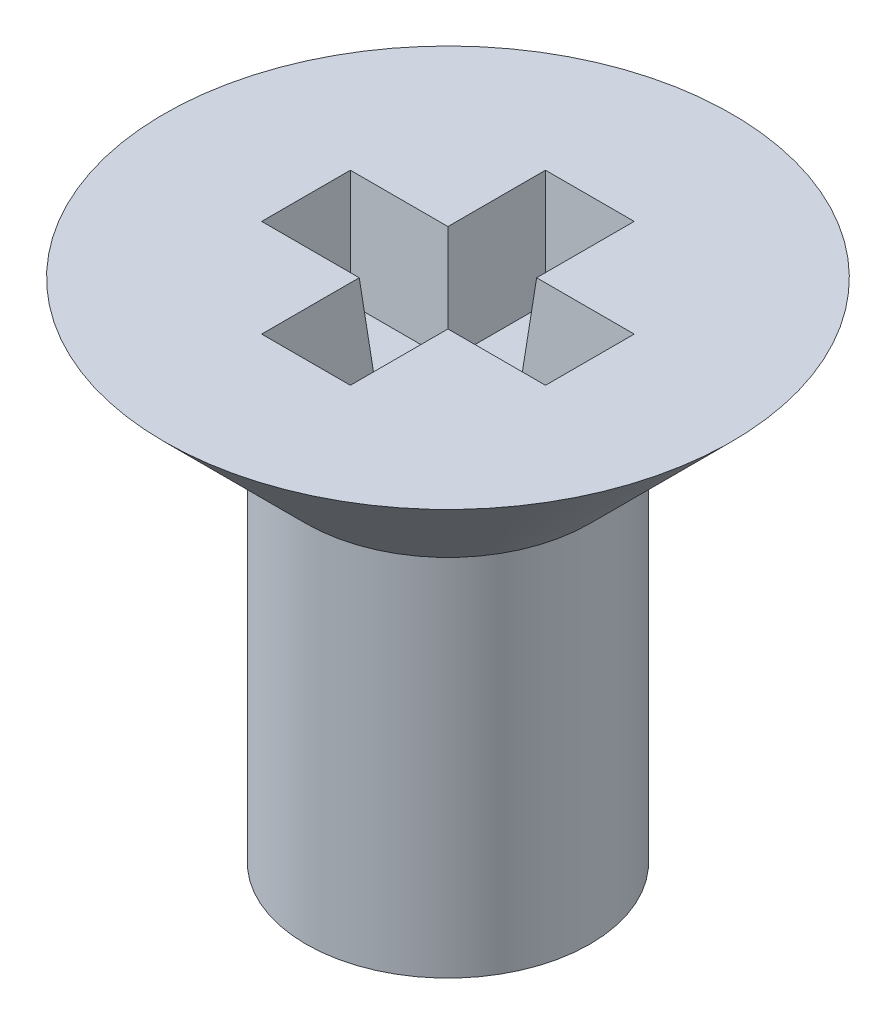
ISO-10303-21;
HEADER;
FILE_DESCRIPTION(('STEP AP214'),'2;1');
FILE_NAME('part.step','',(''),(''),'','','');
FILE_SCHEMA(('AUTOMOTIVE_DESIGN { 1 0 10303 214 1 1 1 1 }'));
ENDSEC;
DATA;
#1=APPLICATION_CONTEXT('core data for automotive mechanical design processes');
#2=APPLICATION_PROTOCOL_DEFINITION('international standard','automotive_design',2000,#1);
#3=PRODUCT_CONTEXT('',#1,'mechanical');
#4=PRODUCT('Part','Part','',(#3));
#5=PRODUCT_RELATED_PRODUCT_CATEGORY('part','',(#4));
#6=PRODUCT_DEFINITION_FORMATION('','',#4);
#7=PRODUCT_DEFINITION_CONTEXT('part definition',#1,'design');
#8=PRODUCT_DEFINITION('design','',#6,#7);
#9=PRODUCT_DEFINITION_SHAPE('','',#8);
#10=(LENGTH_UNIT() NAMED_UNIT(*) SI_UNIT(.MILLI.,.METRE.));
#11=(NAMED_UNIT(*) PLANE_ANGLE_UNIT() SI_UNIT($,.RADIAN.));
#12=(NAMED_UNIT(*) SI_UNIT($,.STERADIAN.) SOLID_ANGLE_UNIT());
#13=UNCERTAINTY_MEASURE_WITH_UNIT(LENGTH_MEASURE(1.E-05),#10,'distance_accuracy_value','');
#14=(GEOMETRIC_REPRESENTATION_CONTEXT(3) GLOBAL_UNCERTAINTY_ASSIGNED_CONTEXT((#13)) GLOBAL_UNIT_ASSIGNED_CONTEXT((#10,
#11,#12)) REPRESENTATION_CONTEXT('',''));
#15=CARTESIAN_POINT('',(0.,0.,0.));
#16=DIRECTION('',(0.,0.,1.));
#17=DIRECTION('',(1.,0.,0.));
#18=AXIS2_PLACEMENT_3D('',#15,#16,#17);
#19=CARTESIAN_POINT('',(0.,0.,0.));
#20=DIRECTION('',(0.,-1.,0.));
#21=DIRECTION('',(0.,0.,-1.));
#22=AXIS2_PLACEMENT_3D('',#19,#20,#21);
#23=PLANE('',#22);
#24=CARTESIAN_POINT('',(0.,0.,0.));
#25=DIRECTION('',(0.,-1.,0.));
#26=DIRECTION('',(0.,0.,-1.));
#27=AXIS2_PLACEMENT_3D('',#24,#25,#26);
#28=CIRCLE('',#27,0.499999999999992);
#29=CARTESIAN_POINT('',(0.,0.,0.499999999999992));
#30=VERTEX_POINT('',#29);
#31=EDGE_CURVE('E11',#30,#30,#28,.T.);
#32=ORIENTED_EDGE('',*,*,#31,.T.);
#33=EDGE_LOOP('',(#32));
#34=FACE_BOUND('',#33,.T.);
#35=ADVANCED_FACE('F30',(#34),#23,.T.);
#36=CARTESIAN_POINT('',(0.,0.,0.));
#37=DIRECTION('',(0.,1.,0.));
#38=DIRECTION('',(0.,0.,1.));
#39=AXIS2_PLACEMENT_3D('',#36,#37,#38);
#40=CYLINDRICAL_SURFACE('',#39,2.);
#41=CARTESIAN_POINT('',(0.,0.866025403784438,0.));
#42=DIRECTION('',(0.,-1.,0.));
#43=DIRECTION('',(0.,0.,-1.));
#44=AXIS2_PLACEMENT_3D('',#41,#42,#43);
#45=CIRCLE('',#44,2.);
#46=CARTESIAN_POINT('',(0.,0.866025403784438,2.));
#47=VERTEX_POINT('',#46);
#48=EDGE_CURVE('E38',#47,#47,#45,.F.);
#49=ORIENTED_EDGE('',*,*,#48,.T.);
#50=EDGE_LOOP('',(#49));
#51=FACE_BOUND('',#50,.T.);
#52=CARTESIAN_POINT('',(0.,6.,0.));
#53=DIRECTION('',(0.,1.,0.));
#54=DIRECTION('',(0.,0.,1.));
#55=AXIS2_PLACEMENT_3D('',#52,#53,#54);
#56=CIRCLE('',#55,2.);
#57=CARTESIAN_POINT('',(0.,6.,2.));
#58=VERTEX_POINT('',#57);
#59=EDGE_CURVE('E226',#58,#58,#56,.T.);
#60=ORIENTED_EDGE('',*,*,#59,.F.);
#61=EDGE_LOOP('',(#60));
#62=FACE_BOUND('',#61,.T.);
#63=ADVANCED_FACE('F231',(#51,#62),#40,.T.);
#64=CARTESIAN_POINT('',(0.,8.,0.));
#65=DIRECTION('',(0.,1.,0.));
#66=DIRECTION('',(0.,0.,1.));
#67=AXIS2_PLACEMENT_3D('',#64,#65,#66);
#68=CONICAL_SURFACE('',#67,4.00000000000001,0.78539816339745);
#69=ORIENTED_EDGE('',*,*,#59,.T.);
#70=EDGE_LOOP('',(#69));
#71=FACE_BOUND('',#70,.T.);
#72=CARTESIAN_POINT('',(0.,8.,0.));
#73=DIRECTION('',(0.,1.,0.));
#74=DIRECTION('',(0.,0.,1.));
#75=AXIS2_PLACEMENT_3D('',#72,#73,#74);
#76=CIRCLE('',#75,4.00000000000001);
#77=CARTESIAN_POINT('',(0.,8.,4.00000000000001));
#78=VERTEX_POINT('',#77);
#79=EDGE_CURVE('E174',#78,#78,#76,.T.);
#80=ORIENTED_EDGE('',*,*,#79,.F.);
#81=EDGE_LOOP('',(#80));
#82=FACE_BOUND('',#81,.T.);
#83=ADVANCED_FACE('F248',(#71,#82),#68,.T.);
#84=CARTESIAN_POINT('',(-4.00000000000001,8.,0.));
#85=DIRECTION('',(0.,1.,0.));
#86=DIRECTION('',(0.,0.,1.));
#87=AXIS2_PLACEMENT_3D('',#84,#85,#86);
#88=PLANE('',#87);
#89=DIRECTION('',(-1.,0.,0.));
#90=VECTOR('',#89,1.);
#91=CARTESIAN_POINT('',(2.,8.,-0.625));
#92=LINE('',#91,#90);
#93=CARTESIAN_POINT('',(2.,8.,-0.625));
#94=VERTEX_POINT('',#93);
#95=CARTESIAN_POINT('',(0.624999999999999,8.,-0.625));
#96=VERTEX_POINT('',#95);
#97=EDGE_CURVE('E45',#94,#96,#92,.T.);
#98=ORIENTED_EDGE('',*,*,#97,.F.);
#99=DIRECTION('',(0.,0.,-1.));
#100=VECTOR('',#99,1.);
#101=CARTESIAN_POINT('',(2.,8.,0.625));
#102=LINE('',#101,#100);
#103=CARTESIAN_POINT('',(2.,8.,0.625));
#104=VERTEX_POINT('',#103);
#105=EDGE_CURVE('E170',#104,#94,#102,.T.);
#106=ORIENTED_EDGE('',*,*,#105,.F.);
#107=DIRECTION('',(1.,0.,0.));
#108=VECTOR('',#107,1.);
#109=CARTESIAN_POINT('',(0.624999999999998,8.,0.625));
#110=LINE('',#109,#108);
#111=CARTESIAN_POINT('',(0.624999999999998,8.,0.625));
#112=VERTEX_POINT('',#111);
#113=EDGE_CURVE('E168',#112,#104,#110,.T.);
#114=ORIENTED_EDGE('',*,*,#113,.F.);
#115=DIRECTION('',(0.,0.,-1.));
#116=VECTOR('',#115,1.);
#117=CARTESIAN_POINT('',(0.624999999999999,8.,2.));
#118=LINE('',#117,#116);
#119=CARTESIAN_POINT('',(0.624999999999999,8.,2.));
#120=VERTEX_POINT('',#119);
#121=EDGE_CURVE('E165',#120,#112,#118,.T.);
#122=ORIENTED_EDGE('',*,*,#121,.F.);
#123=DIRECTION('',(1.,0.,0.));
#124=VECTOR('',#123,1.);
#125=CARTESIAN_POINT('',(-0.625000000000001,8.,2.));
#126=LINE('',#125,#124);
#127=CARTESIAN_POINT('',(-0.625000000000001,8.,2.));
#128=VERTEX_POINT('',#127);
#129=EDGE_CURVE('E162',#128,#120,#126,.T.);
#130=ORIENTED_EDGE('',*,*,#129,.F.);
#131=DIRECTION('',(0.,0.,1.));
#132=VECTOR('',#131,1.);
#133=CARTESIAN_POINT('',(-0.625000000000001,8.,0.625));
#134=LINE('',#133,#132);
#135=CARTESIAN_POINT('',(-0.625000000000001,8.,0.625));
#136=VERTEX_POINT('',#135);
#137=EDGE_CURVE('E159',#136,#128,#134,.T.);
#138=ORIENTED_EDGE('',*,*,#137,.F.);
#139=DIRECTION('',(1.,0.,0.));
#140=VECTOR('',#139,1.);
#141=CARTESIAN_POINT('',(-2.,8.,0.625));
#142=LINE('',#141,#140);
#143=CARTESIAN_POINT('',(-2.,8.,0.625));
#144=VERTEX_POINT('',#143);
#145=EDGE_CURVE('E156',#144,#136,#142,.T.);
#146=ORIENTED_EDGE('',*,*,#145,.F.);
#147=DIRECTION('',(0.,0.,1.));
#148=VECTOR('',#147,1.);
#149=CARTESIAN_POINT('',(-2.,8.,0.625));
#150=LINE('',#149,#148);
#151=CARTESIAN_POINT('',(-2.,8.,-0.625));
#152=VERTEX_POINT('',#151);
#153=EDGE_CURVE('E153',#152,#144,#150,.T.);
#154=ORIENTED_EDGE('',*,*,#153,.F.);
#155=DIRECTION('',(-1.,0.,0.));
#156=VECTOR('',#155,1.);
#157=CARTESIAN_POINT('',(-0.625000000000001,8.,-0.625));
#158=LINE('',#157,#156);
#159=CARTESIAN_POINT('',(-0.625000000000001,8.,-0.625));
#160=VERTEX_POINT('',#159);
#161=EDGE_CURVE('E147',#160,#152,#158,.T.);
#162=ORIENTED_EDGE('',*,*,#161,.F.);
#163=DIRECTION('',(0.,0.,1.));
#164=VECTOR('',#163,1.);
#165=CARTESIAN_POINT('',(-0.625000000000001,8.,-2.));
#166=LINE('',#165,#164);
#167=CARTESIAN_POINT('',(-0.625000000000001,8.,-2.));
#168=VERTEX_POINT('',#167);
#169=EDGE_CURVE('E145',#168,#160,#166,.T.);
#170=ORIENTED_EDGE('',*,*,#169,.F.);
#171=DIRECTION('',(-1.,0.,0.));
#172=VECTOR('',#171,1.);
#173=CARTESIAN_POINT('',(-0.625000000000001,8.,-2.));
#174=LINE('',#173,#172);
#175=CARTESIAN_POINT('',(0.624999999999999,8.,-2.));
#176=VERTEX_POINT('',#175);
#177=EDGE_CURVE('E128',#176,#168,#174,.T.);
#178=ORIENTED_EDGE('',*,*,#177,.F.);
#179=DIRECTION('',(0.,0.,-1.));
#180=VECTOR('',#179,1.);
#181=CARTESIAN_POINT('',(0.624999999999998,8.,-0.625));
#182=LINE('',#181,#180);
#183=EDGE_CURVE('E137',#96,#176,#182,.T.);
#184=ORIENTED_EDGE('',*,*,#183,.F.);
#185=EDGE_LOOP('',(#98,#106,#114,#122,#130,#138,#146,#154,#162,#170,#178,#184));
#186=FACE_BOUND('',#185,.T.);
#187=ORIENTED_EDGE('',*,*,#79,.T.);
#188=EDGE_LOOP('',(#187));
#189=FACE_BOUND('',#188,.T.);
#190=ADVANCED_FACE('F141',(#186,#189),#88,.T.);
#191=CARTESIAN_POINT('',(2.,8.,-0.625));
#192=DIRECTION('',(0.,-0.0871557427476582,-0.996194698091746));
#193=DIRECTION('',(0.,0.996194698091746,-0.0871557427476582));
#194=AXIS2_PLACEMENT_3D('',#191,#192,#193);
#195=PLANE('',#194);
#196=ORIENTED_EDGE('',*,*,#97,.T.);
#197=DIRECTION('',(0.0868265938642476,0.992432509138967,-0.0868265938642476));
#198=VECTOR('',#197,1.);
#199=CARTESIAN_POINT('',(0.624999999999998,8.,-0.625));
#200=LINE('',#199,#198);
#201=CARTESIAN_POINT('',(0.493767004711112,6.5,-0.493767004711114));
#202=VERTEX_POINT('',#201);
#203=EDGE_CURVE('E88',#202,#96,#200,.T.);
#204=ORIENTED_EDGE('',*,*,#203,.F.);
#205=DIRECTION('',(-1.,0.,0.));
#206=VECTOR('',#205,1.);
#207=CARTESIAN_POINT('',(2.,6.5,-0.493767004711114));
#208=LINE('',#207,#206);
#209=CARTESIAN_POINT('',(1.86876700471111,6.5,-0.493767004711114));
#210=VERTEX_POINT('',#209);
#211=EDGE_CURVE('E172',#210,#202,#208,.T.);
#212=ORIENTED_EDGE('',*,*,#211,.F.);
#213=DIRECTION('',(0.0868265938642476,0.992432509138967,-0.0868265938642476));
#214=VECTOR('',#213,1.);
#215=CARTESIAN_POINT('',(1.99057642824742,7.89228808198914,-0.615576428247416));
#216=LINE('',#215,#214);
#217=EDGE_CURVE('E53',#210,#94,#216,.T.);
#218=ORIENTED_EDGE('',*,*,#217,.T.);
#219=EDGE_LOOP('',(#196,#204,#212,#218));
#220=FACE_BOUND('',#219,.T.);
#221=ADVANCED_FACE('F256',(#220),#195,.F.);
#222=CARTESIAN_POINT('',(2.,8.,0.625));
#223=DIRECTION('',(0.996194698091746,-0.0871557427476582,0.));
#224=DIRECTION('',(0.0871557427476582,0.996194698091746,0.));
#225=AXIS2_PLACEMENT_3D('',#222,#223,#224);
#226=PLANE('',#225);
#227=ORIENTED_EDGE('',*,*,#105,.T.);
#228=ORIENTED_EDGE('',*,*,#217,.F.);
#229=DIRECTION('',(0.,0.,-1.));
#230=VECTOR('',#229,1.);
#231=CARTESIAN_POINT('',(1.86876700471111,6.5,0.625));
#232=LINE('',#231,#230);
#233=CARTESIAN_POINT('',(1.86876700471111,6.5,0.493767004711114));
#234=VERTEX_POINT('',#233);
#235=EDGE_CURVE('E175',#234,#210,#232,.T.);
#236=ORIENTED_EDGE('',*,*,#235,.F.);
#237=DIRECTION('',(0.0868265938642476,0.992432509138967,0.0868265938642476));
#238=VECTOR('',#237,1.);
#239=CARTESIAN_POINT('',(1.98963407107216,7.88151689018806,0.614634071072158));
#240=LINE('',#239,#238);
#241=EDGE_CURVE('E93',#234,#104,#240,.T.);
#242=ORIENTED_EDGE('',*,*,#241,.T.);
#243=EDGE_LOOP('',(#227,#228,#236,#242));
#244=FACE_BOUND('',#243,.T.);
#245=ADVANCED_FACE('F257',(#244),#226,.F.);
#246=CARTESIAN_POINT('',(0.624999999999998,8.,0.625));
#247=DIRECTION('',(0.,-0.0871557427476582,0.996194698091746));
#248=DIRECTION('',(0.,-0.996194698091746,-0.0871557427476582));
#249=AXIS2_PLACEMENT_3D('',#246,#247,#248);
#250=PLANE('',#249);
#251=ORIENTED_EDGE('',*,*,#113,.T.);
#252=ORIENTED_EDGE('',*,*,#241,.F.);
#253=DIRECTION('',(1.,0.,0.));
#254=VECTOR('',#253,1.);
#255=CARTESIAN_POINT('',(0.624999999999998,6.5,0.493767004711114));
#256=LINE('',#255,#254);
#257=CARTESIAN_POINT('',(0.493767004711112,6.5,0.493767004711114));
#258=VERTEX_POINT('',#257);
#259=EDGE_CURVE('E198',#258,#234,#256,.T.);
#260=ORIENTED_EDGE('',*,*,#259,.F.);
#261=DIRECTION('',(0.0868265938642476,0.992432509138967,0.0868265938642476));
#262=VECTOR('',#261,1.);
#263=CARTESIAN_POINT('',(0.624999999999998,8.,0.625));
#264=LINE('',#263,#262);
#265=EDGE_CURVE('E190',#258,#112,#264,.T.);
#266=ORIENTED_EDGE('',*,*,#265,.T.);
#267=EDGE_LOOP('',(#251,#252,#260,#266));
#268=FACE_BOUND('',#267,.T.);
#269=ADVANCED_FACE('F260',(#268),#250,.F.);
#270=CARTESIAN_POINT('',(0.624999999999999,8.,2.));
#271=DIRECTION('',(0.996194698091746,-0.0871557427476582,0.));
#272=DIRECTION('',(0.0871557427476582,0.996194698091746,0.));
#273=AXIS2_PLACEMENT_3D('',#270,#271,#272);
#274=PLANE('',#273);
#275=ORIENTED_EDGE('',*,*,#121,.T.);
#276=ORIENTED_EDGE('',*,*,#265,.F.);
#277=DIRECTION('',(0.,0.,-1.));
#278=VECTOR('',#277,1.);
#279=CARTESIAN_POINT('',(0.493767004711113,6.5,2.));
#280=LINE('',#279,#278);
#281=CARTESIAN_POINT('',(0.493767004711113,6.5,1.86876700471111));
#282=VERTEX_POINT('',#281);
#283=EDGE_CURVE('E201',#282,#258,#280,.T.);
#284=ORIENTED_EDGE('',*,*,#283,.F.);
#285=DIRECTION('',(0.0868265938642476,0.992432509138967,0.0868265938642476));
#286=VECTOR('',#285,1.);
#287=CARTESIAN_POINT('',(0.615576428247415,7.89228808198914,1.99057642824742));
#288=LINE('',#287,#286);
#289=EDGE_CURVE('E188',#282,#120,#288,.T.);
#290=ORIENTED_EDGE('',*,*,#289,.T.);
#291=EDGE_LOOP('',(#275,#276,#284,#290));
#292=FACE_BOUND('',#291,.T.);
#293=ADVANCED_FACE('F263',(#292),#274,.F.);
#294=CARTESIAN_POINT('',(-0.625000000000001,8.,2.));
#295=DIRECTION('',(0.,-0.0871557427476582,0.996194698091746));
#296=DIRECTION('',(0.,-0.996194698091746,-0.0871557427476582));
#297=AXIS2_PLACEMENT_3D('',#294,#295,#296);
#298=PLANE('',#297);
#299=ORIENTED_EDGE('',*,*,#129,.T.);
#300=ORIENTED_EDGE('',*,*,#289,.F.);
#301=DIRECTION('',(1.,0.,0.));
#302=VECTOR('',#301,1.);
#303=CARTESIAN_POINT('',(-0.625000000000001,6.5,1.86876700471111));
#304=LINE('',#303,#302);
#305=CARTESIAN_POINT('',(-0.493767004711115,6.5,1.86876700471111));
#306=VERTEX_POINT('',#305);
#307=EDGE_CURVE('E204',#306,#282,#304,.T.);
#308=ORIENTED_EDGE('',*,*,#307,.F.);
#309=DIRECTION('',(-0.0868265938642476,0.992432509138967,0.0868265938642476));
#310=VECTOR('',#309,1.);
#311=CARTESIAN_POINT('',(-0.614634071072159,7.88151689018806,1.98963407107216));
#312=LINE('',#311,#310);
#313=EDGE_CURVE('E186',#306,#128,#312,.T.);
#314=ORIENTED_EDGE('',*,*,#313,.T.);
#315=EDGE_LOOP('',(#299,#300,#308,#314));
#316=FACE_BOUND('',#315,.T.);
#317=ADVANCED_FACE('F267',(#316),#298,.F.);
#318=CARTESIAN_POINT('',(-0.625000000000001,8.,0.625));
#319=DIRECTION('',(-0.996194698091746,-0.0871557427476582,0.));
#320=DIRECTION('',(0.0871557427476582,-0.996194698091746,0.));
#321=AXIS2_PLACEMENT_3D('',#318,#319,#320);
#322=PLANE('',#321);
#323=ORIENTED_EDGE('',*,*,#137,.T.);
#324=ORIENTED_EDGE('',*,*,#313,.F.);
#325=DIRECTION('',(0.,0.,1.));
#326=VECTOR('',#325,1.);
#327=CARTESIAN_POINT('',(-0.493767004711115,6.5,0.625));
#328=LINE('',#327,#326);
#329=CARTESIAN_POINT('',(-0.493767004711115,6.5,0.493767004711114));
#330=VERTEX_POINT('',#329);
#331=EDGE_CURVE('E207',#330,#306,#328,.T.);
#332=ORIENTED_EDGE('',*,*,#331,.F.);
#333=DIRECTION('',(-0.0868265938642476,0.992432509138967,0.0868265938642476));
#334=VECTOR('',#333,1.);
#335=CARTESIAN_POINT('',(-0.625000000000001,8.,0.625));
#336=LINE('',#335,#334);
#337=EDGE_CURVE('E184',#330,#136,#336,.T.);
#338=ORIENTED_EDGE('',*,*,#337,.T.);
#339=EDGE_LOOP('',(#323,#324,#332,#338));
#340=FACE_BOUND('',#339,.T.);
#341=ADVANCED_FACE('F271',(#340),#322,.F.);
#342=CARTESIAN_POINT('',(-2.,8.,0.625));
#343=DIRECTION('',(0.,-0.0871557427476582,0.996194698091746));
#344=DIRECTION('',(0.,-0.996194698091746,-0.0871557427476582));
#345=AXIS2_PLACEMENT_3D('',#342,#343,#344);
#346=PLANE('',#345);
#347=ORIENTED_EDGE('',*,*,#145,.T.);
#348=ORIENTED_EDGE('',*,*,#337,.F.);
#349=DIRECTION('',(1.,0.,0.));
#350=VECTOR('',#349,1.);
#351=CARTESIAN_POINT('',(-2.,6.5,0.493767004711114));
#352=LINE('',#351,#350);
#353=CARTESIAN_POINT('',(-1.86876700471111,6.5,0.493767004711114));
#354=VERTEX_POINT('',#353);
#355=EDGE_CURVE('E210',#354,#330,#352,.T.);
#356=ORIENTED_EDGE('',*,*,#355,.F.);
#357=DIRECTION('',(-0.0868265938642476,0.992432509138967,0.0868265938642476));
#358=VECTOR('',#357,1.);
#359=CARTESIAN_POINT('',(-2.,8.,0.625));
#360=LINE('',#359,#358);
#361=EDGE_CURVE('E182',#354,#144,#360,.T.);
#362=ORIENTED_EDGE('',*,*,#361,.T.);
#363=EDGE_LOOP('',(#347,#348,#356,#362));
#364=FACE_BOUND('',#363,.T.);
#365=ADVANCED_FACE('F275',(#364),#346,.F.);
#366=CARTESIAN_POINT('',(-2.,8.,0.625));
#367=DIRECTION('',(-0.996194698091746,-0.0871557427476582,0.));
#368=DIRECTION('',(0.0871557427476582,-0.996194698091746,0.));
#369=AXIS2_PLACEMENT_3D('',#366,#367,#368);
#370=PLANE('',#369);
#371=ORIENTED_EDGE('',*,*,#153,.T.);
#372=ORIENTED_EDGE('',*,*,#361,.F.);
#373=DIRECTION('',(0.,0.,1.));
#374=VECTOR('',#373,1.);
#375=CARTESIAN_POINT('',(-1.86876700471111,6.5,0.625));
#376=LINE('',#375,#374);
#377=CARTESIAN_POINT('',(-1.86876700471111,6.5,-0.493767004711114));
#378=VERTEX_POINT('',#377);
#379=EDGE_CURVE('E213',#378,#354,#376,.T.);
#380=ORIENTED_EDGE('',*,*,#379,.F.);
#381=DIRECTION('',(-0.0868265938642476,0.992432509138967,-0.0868265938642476));
#382=VECTOR('',#381,1.);
#383=CARTESIAN_POINT('',(-1.98963407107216,7.88151689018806,-0.614634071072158));
#384=LINE('',#383,#382);
#385=EDGE_CURVE('E180',#378,#152,#384,.T.);
#386=ORIENTED_EDGE('',*,*,#385,.T.);
#387=EDGE_LOOP('',(#371,#372,#380,#386));
#388=FACE_BOUND('',#387,.T.);
#389=ADVANCED_FACE('F279',(#388),#370,.F.);
#390=CARTESIAN_POINT('',(-0.625000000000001,8.,-0.625));
#391=DIRECTION('',(0.,-0.0871557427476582,-0.996194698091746));
#392=DIRECTION('',(0.,0.996194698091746,-0.0871557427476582));
#393=AXIS2_PLACEMENT_3D('',#390,#391,#392);
#394=PLANE('',#393);
#395=ORIENTED_EDGE('',*,*,#161,.T.);
#396=ORIENTED_EDGE('',*,*,#385,.F.);
#397=DIRECTION('',(-1.,0.,0.));
#398=VECTOR('',#397,1.);
#399=CARTESIAN_POINT('',(-0.625000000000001,6.5,-0.493767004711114));
#400=LINE('',#399,#398);
#401=CARTESIAN_POINT('',(-0.493767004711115,6.5,-0.493767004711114));
#402=VERTEX_POINT('',#401);
#403=EDGE_CURVE('E216',#402,#378,#400,.T.);
#404=ORIENTED_EDGE('',*,*,#403,.F.);
#405=DIRECTION('',(-0.0868265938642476,0.992432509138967,-0.0868265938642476));
#406=VECTOR('',#405,1.);
#407=CARTESIAN_POINT('',(-0.625000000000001,8.,-0.625));
#408=LINE('',#407,#406);
#409=EDGE_CURVE('E178',#402,#160,#408,.T.);
#410=ORIENTED_EDGE('',*,*,#409,.T.);
#411=EDGE_LOOP('',(#395,#396,#404,#410));
#412=FACE_BOUND('',#411,.T.);
#413=ADVANCED_FACE('F283',(#412),#394,.F.);
#414=CARTESIAN_POINT('',(-0.625000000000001,8.,-2.));
#415=DIRECTION('',(-0.996194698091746,-0.0871557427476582,0.));
#416=DIRECTION('',(0.0871557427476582,-0.996194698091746,0.));
#417=AXIS2_PLACEMENT_3D('',#414,#415,#416);
#418=PLANE('',#417);
#419=ORIENTED_EDGE('',*,*,#169,.T.);
#420=ORIENTED_EDGE('',*,*,#409,.F.);
#421=DIRECTION('',(0.,0.,1.));
#422=VECTOR('',#421,1.);
#423=CARTESIAN_POINT('',(-0.493767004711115,6.5,-2.));
#424=LINE('',#423,#422);
#425=CARTESIAN_POINT('',(-0.493767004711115,6.5,-1.86876700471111));
#426=VERTEX_POINT('',#425);
#427=EDGE_CURVE('E219',#426,#402,#424,.T.);
#428=ORIENTED_EDGE('',*,*,#427,.F.);
#429=DIRECTION('',(-0.0868265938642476,0.992432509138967,-0.0868265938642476));
#430=VECTOR('',#429,1.);
#431=CARTESIAN_POINT('',(-0.625000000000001,8.,-2.));
#432=LINE('',#431,#430);
#433=EDGE_CURVE('E134',#426,#168,#432,.T.);
#434=ORIENTED_EDGE('',*,*,#433,.T.);
#435=EDGE_LOOP('',(#419,#420,#428,#434));
#436=FACE_BOUND('',#435,.T.);
#437=ADVANCED_FACE('F287',(#436),#418,.F.);
#438=CARTESIAN_POINT('',(-0.625000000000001,8.,-2.));
#439=DIRECTION('',(0.,-0.0871557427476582,-0.996194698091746));
#440=DIRECTION('',(0.,0.996194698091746,-0.0871557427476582));
#441=AXIS2_PLACEMENT_3D('',#438,#439,#440);
#442=PLANE('',#441);
#443=ORIENTED_EDGE('',*,*,#177,.T.);
#444=ORIENTED_EDGE('',*,*,#433,.F.);
#445=DIRECTION('',(-1.,0.,0.));
#446=VECTOR('',#445,1.);
#447=CARTESIAN_POINT('',(-0.625000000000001,6.5,-1.86876700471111));
#448=LINE('',#447,#446);
#449=CARTESIAN_POINT('',(0.493767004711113,6.5,-1.86876700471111));
#450=VERTEX_POINT('',#449);
#451=EDGE_CURVE('E131',#450,#426,#448,.T.);
#452=ORIENTED_EDGE('',*,*,#451,.F.);
#453=DIRECTION('',(0.0868265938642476,0.992432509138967,-0.0868265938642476));
#454=VECTOR('',#453,1.);
#455=CARTESIAN_POINT('',(0.614634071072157,7.88151689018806,-1.98963407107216));
#456=LINE('',#455,#454);
#457=EDGE_CURVE('E124',#450,#176,#456,.T.);
#458=ORIENTED_EDGE('',*,*,#457,.T.);
#459=EDGE_LOOP('',(#443,#444,#452,#458));
#460=FACE_BOUND('',#459,.T.);
#461=ADVANCED_FACE('F126',(#460),#442,.F.);
#462=CARTESIAN_POINT('',(0.624999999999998,8.,-0.625));
#463=DIRECTION('',(0.996194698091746,-0.0871557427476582,0.));
#464=DIRECTION('',(0.0871557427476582,0.996194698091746,0.));
#465=AXIS2_PLACEMENT_3D('',#462,#463,#464);
#466=PLANE('',#465);
#467=ORIENTED_EDGE('',*,*,#183,.T.);
#468=ORIENTED_EDGE('',*,*,#457,.F.);
#469=DIRECTION('',(0.,0.,-1.));
#470=VECTOR('',#469,1.);
#471=CARTESIAN_POINT('',(0.493767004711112,6.5,-0.625));
#472=LINE('',#471,#470);
#473=EDGE_CURVE('E195',#202,#450,#472,.T.);
#474=ORIENTED_EDGE('',*,*,#473,.F.);
#475=ORIENTED_EDGE('',*,*,#203,.T.);
#476=EDGE_LOOP('',(#467,#468,#474,#475));
#477=FACE_BOUND('',#476,.T.);
#478=ADVANCED_FACE('F138',(#477),#466,.F.);
#479=CARTESIAN_POINT('',(0.624999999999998,6.5,-0.625));
#480=DIRECTION('',(0.,-1.,0.));
#481=DIRECTION('',(0.,0.,-1.));
#482=AXIS2_PLACEMENT_3D('',#479,#480,#481);
#483=PLANE('',#482);
#484=ORIENTED_EDGE('',*,*,#211,.T.);
#485=ORIENTED_EDGE('',*,*,#473,.T.);
#486=ORIENTED_EDGE('',*,*,#451,.T.);
#487=ORIENTED_EDGE('',*,*,#427,.T.);
#488=ORIENTED_EDGE('',*,*,#403,.T.);
#489=ORIENTED_EDGE('',*,*,#379,.T.);
#490=ORIENTED_EDGE('',*,*,#355,.T.);
#491=ORIENTED_EDGE('',*,*,#331,.T.);
#492=ORIENTED_EDGE('',*,*,#307,.T.);
#493=ORIENTED_EDGE('',*,*,#283,.T.);
#494=ORIENTED_EDGE('',*,*,#259,.T.);
#495=ORIENTED_EDGE('',*,*,#235,.T.);
#496=EDGE_LOOP('',(#484,#485,#486,#487,#488,#489,#490,#491,#492,#493,#494,#495));
#497=FACE_BOUND('',#496,.T.);
#498=ADVANCED_FACE('F235',(#497),#483,.F.);
#499=CARTESIAN_POINT('',(0.,0.866025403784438,0.));
#500=DIRECTION('',(0.,1.,0.));
#501=DIRECTION('',(0.,0.,1.));
#502=AXIS2_PLACEMENT_3D('',#499,#500,#501);
#503=CONICAL_SURFACE('',#502,2.,1.0471975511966);
#504=CARTESIAN_POINT('',(0.,0.,0.499999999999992));
#505=CARTESIAN_POINT('',(0.,0.00902109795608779,0.515624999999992));
#506=CARTESIAN_POINT('',(0.,0.0180421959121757,0.531249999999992));
#507=CARTESIAN_POINT('',(0.,0.0360843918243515,0.562499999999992));
#508=CARTESIAN_POINT('',(0.,0.0451054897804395,0.578124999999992));
#509=CARTESIAN_POINT('',(0.,0.0631476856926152,0.609374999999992));
#510=CARTESIAN_POINT('',(0.,0.0721687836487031,0.624999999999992));
#511=CARTESIAN_POINT('',(0.,0.0902109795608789,0.656249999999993));
#512=CARTESIAN_POINT('',(0.,0.0992320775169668,0.671874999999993));
#513=CARTESIAN_POINT('',(0.,0.117274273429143,0.703124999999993));
#514=CARTESIAN_POINT('',(0.,0.126295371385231,0.718749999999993));
#515=CARTESIAN_POINT('',(0.,0.144337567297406,0.749999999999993));
#516=CARTESIAN_POINT('',(0.,0.153358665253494,0.765624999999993));
#517=CARTESIAN_POINT('',(0.,0.17140086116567,0.796874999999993));
#518=CARTESIAN_POINT('',(0.,0.180421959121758,0.812499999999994));
#519=CARTESIAN_POINT('',(0.,0.198464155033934,0.843749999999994));
#520=CARTESIAN_POINT('',(0.,0.207485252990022,0.859374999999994));
#521=CARTESIAN_POINT('',(0.,0.225527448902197,0.890624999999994));
#522=CARTESIAN_POINT('',(0.,0.234548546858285,0.906249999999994));
#523=CARTESIAN_POINT('',(0.,0.252590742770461,0.937499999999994));
#524=CARTESIAN_POINT('',(0.,0.261611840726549,0.953124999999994));
#525=CARTESIAN_POINT('',(0.,0.279654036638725,0.984374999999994));
#526=CARTESIAN_POINT('',(0.,0.288675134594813,0.999999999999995));
#527=CARTESIAN_POINT('',(0.,0.306717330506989,1.03124999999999));
#528=CARTESIAN_POINT('',(0.,0.315738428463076,1.04687499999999));
#529=CARTESIAN_POINT('',(0.,0.333780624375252,1.078125));
#530=CARTESIAN_POINT('',(0.,0.34280172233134,1.09375));
#531=CARTESIAN_POINT('',(0.,0.360843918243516,1.125));
#532=CARTESIAN_POINT('',(0.,0.369865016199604,1.140625));
#533=CARTESIAN_POINT('',(0.,0.38790721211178,1.171875));
#534=CARTESIAN_POINT('',(0.,0.396928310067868,1.1875));
#535=CARTESIAN_POINT('',(0.,0.414970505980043,1.21875));
#536=CARTESIAN_POINT('',(0.,0.423991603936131,1.234375));
#537=CARTESIAN_POINT('',(0.,0.442033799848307,1.265625));
#538=CARTESIAN_POINT('',(0.,0.451054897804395,1.28125));
#539=CARTESIAN_POINT('',(0.,0.469097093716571,1.3125));
#540=CARTESIAN_POINT('',(0.,0.478118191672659,1.328125));
#541=CARTESIAN_POINT('',(0.,0.496160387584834,1.359375));
#542=CARTESIAN_POINT('',(0.,0.505181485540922,1.375));
#543=CARTESIAN_POINT('',(0.,0.523223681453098,1.40625));
#544=CARTESIAN_POINT('',(0.,0.532244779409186,1.421875));
#545=CARTESIAN_POINT('',(0.,0.550286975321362,1.453125));
#546=CARTESIAN_POINT('',(0.,0.55930807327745,1.46875));
#547=CARTESIAN_POINT('',(0.,0.577350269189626,1.5));
#548=CARTESIAN_POINT('',(0.,0.586371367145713,1.515625));
#549=CARTESIAN_POINT('',(0.,0.604413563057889,1.546875));
#550=CARTESIAN_POINT('',(0.,0.613434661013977,1.5625));
#551=CARTESIAN_POINT('',(0.,0.631476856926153,1.59375));
#552=CARTESIAN_POINT('',(0.,0.640497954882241,1.609375));
#553=CARTESIAN_POINT('',(0.,0.658540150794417,1.640625));
#554=CARTESIAN_POINT('',(0.,0.667561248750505,1.65625));
#555=CARTESIAN_POINT('',(0.,0.685603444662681,1.6875));
#556=CARTESIAN_POINT('',(0.,0.694624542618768,1.703125));
#557=CARTESIAN_POINT('',(0.,0.712666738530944,1.734375));
#558=CARTESIAN_POINT('',(0.,0.721687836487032,1.75));
#559=CARTESIAN_POINT('',(0.,0.739730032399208,1.78125));
#560=CARTESIAN_POINT('',(0.,0.748751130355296,1.796875));
#561=CARTESIAN_POINT('',(0.,0.766793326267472,1.828125));
#562=CARTESIAN_POINT('',(0.,0.77581442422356,1.84375));
#563=CARTESIAN_POINT('',(0.,0.793856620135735,1.875));
#564=CARTESIAN_POINT('',(0.,0.802877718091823,1.890625));
#565=CARTESIAN_POINT('',(0.,0.820919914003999,1.921875));
#566=CARTESIAN_POINT('',(0.,0.829941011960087,1.9375));
#567=CARTESIAN_POINT('',(0.,0.847983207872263,1.96875));
#568=CARTESIAN_POINT('',(0.,0.85700430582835,1.984375));
#569=CARTESIAN_POINT('',(0.,0.866025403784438,2.));
#570=B_SPLINE_CURVE_WITH_KNOTS('',3,(#504,#505,#506,#507,#508,#509,#510,#511,#512,#513,#514,
#515,#516,#517,#518,#519,#520,#521,#522,#523,#524,#525,#526,#527,#528,#529,#530,#531,#532,#533,
#534,#535,#536,#537,#538,#539,#540,#541,#542,#543,#544,#545,#546,#547,#548,#549,#550,#551,#552,
#553,#554,#555,#556,#557,#558,#559,#560,#561,#562,#563,#564,#565,#566,#567,#568,#569),
.UNSPECIFIED.,.F.,.F.,(4,2,2,2,2,2,2,2,2,2,2,2,2,2,2,2,2,2,2,2,2,2,2,2,2,2,2,2,2,2,2,2,4),(0.,
0.0541265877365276,0.108253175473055,0.162379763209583,0.216506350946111,0.270632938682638,
0.324759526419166,0.378886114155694,0.433012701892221,0.487139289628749,0.541265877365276,
0.595392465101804,0.649519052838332,0.703645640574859,0.757772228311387,0.811898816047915,
0.866025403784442,0.92015199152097,0.974278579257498,1.02840516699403,1.08253175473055,
1.13665834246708,1.19078493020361,1.24491151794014,1.29903810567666,1.35316469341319,
1.40729128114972,1.46141786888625,1.51554445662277,1.5696710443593,1.62379763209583,
1.67792421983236,1.73205080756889),.UNSPECIFIED.);
#571=EDGE_CURVE('BSEAM32',#30,#47,#570,.T.);
#572=ORIENTED_EDGE('',*,*,#31,.F.);
#573=ORIENTED_EDGE('',*,*,#48,.F.);
#574=ORIENTED_EDGE('',*,*,#571,.T.);
#575=ORIENTED_EDGE('',*,*,#571,.F.);
#576=EDGE_LOOP('',(#572,#574,#573,#575));
#577=FACE_BOUND('',#576,.T.);
#578=ADVANCED_FACE('F32',(#577),#503,.T.);
#579=CLOSED_SHELL('',(#35,#63,#83,#190,#221,#245,#269,#293,#317,#341,#365,#389,#413,#437,#461,
#478,#498,#578));
#580=MANIFOLD_SOLID_BREP('B2',#579);
#581=ADVANCED_BREP_SHAPE_REPRESENTATION('',(#18,#580),#14);
#582=SHAPE_DEFINITION_REPRESENTATION(#9,#581);
ENDSEC;
END-ISO-10303-21;
